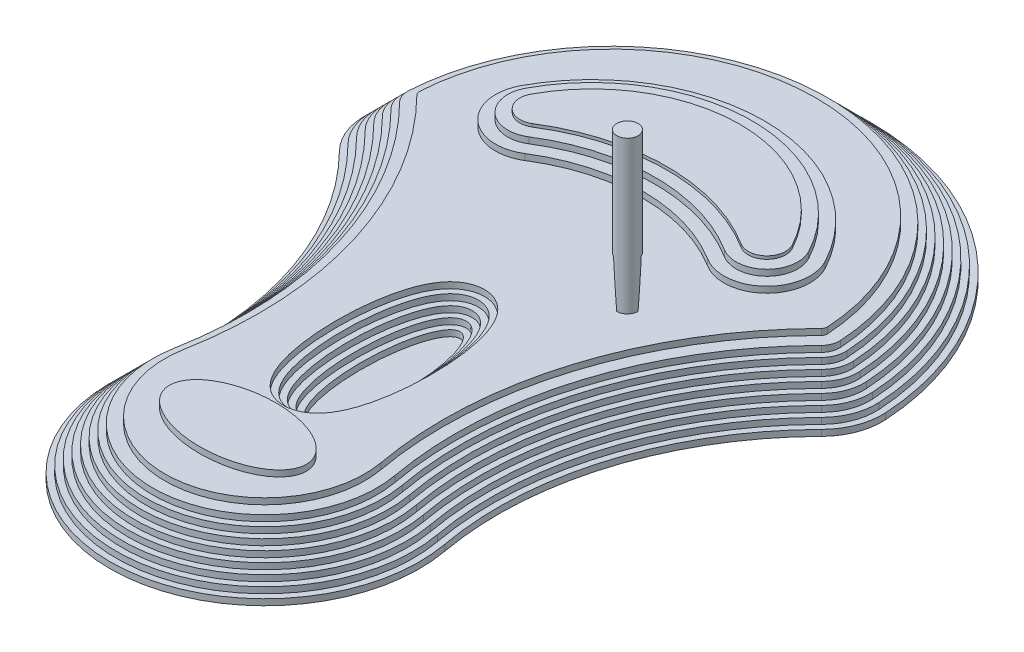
from build123d import *

# Parameters (mm, degrees)
BOSS_EXTRUDE1_DEPTH          = 2
BOSS_EXTRUDE2_DEPTH          = 2
BOSS_EXTRUDE3_DEPTH          = 2
BOSS_EXTRUDE4_DEPTH          = 2
SKETCH6_RX                   = 25
SKETCH6_RY                   = 7.5
BOSS_EXTRUDE5_DEPTH          = 2
BOSS_EXTRUDE6_DEPTH          = 2
BOSS_EXTRUDE7_DEPTH          = 2
BOSS_EXTRUDE8_DEPTH          = 2
BOSS_EXTRUDE9_DEPTH          = 2
SKETCH11_RX                  = 22.5
SKETCH11_RY                  = 12.5
BOSS_EXTRUDE10_DEPTH         = 2
BOSS_EXTRUDE11_DEPTH         = 2
BOSS_EXTRUDE12_DEPTH         = 1
BOSS_EXTRUDE13_START         = 2
SKETCH14_R                   = 3.5
BOSS_EXTRUDE13_DEPTH         = 50
CUT_EXTRUDE1_DEPTH           = 15
CUT_EXTRUDE1_DRAFT           = -5
CUT_EXTRUDE1_PROFILE_2_DEPTH = 15
CUT_EXTRUDE1_PROFILE_2_DRAFT = -5


with BuildPart() as part:
    # Sketch2 → Boss-Extrude1 (new body)
    with BuildSketch(Plane(origin=(0, 0, 0), x_dir=(1, 0, 0), z_dir=(0, 1, 0))):
        with BuildLine():
            ThreePointArc((84.993020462, 169.842764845), (0, 250), (-84.993020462, 169.842764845))
            ThreePointArc((-84.993020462, 169.842764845), (-83.737303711, 161.606035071), (-79.234438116, 154.595703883))
            ThreePointArc((-79.234438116, 154.595703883), (-53.016197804, 110.883102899), (-50, 60))
            ThreePointArc((-50, 60), (0, 0), (50, 60))
            ThreePointArc((50, 60), (53.016197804, 110.883102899), (79.234438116, 154.595703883))
            ThreePointArc((79.234438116, 154.595703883), (83.737303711, 161.606035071), (84.993020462, 169.842764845))
        make_face()
    extrude(amount=BOSS_EXTRUDE1_DEPTH)

    # Sketch3 → Boss-Extrude2 (add)
    with BuildSketch(Plane(origin=(0, 2, 0), x_dir=(1, 0, 0), z_dir=(0, 1, 0))):
        with BuildLine():
            ThreePointArc((77.81372295, 156.003385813), (81.866301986, 162.312683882), (82.996447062, 169.725740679))
            ThreePointArc((82.996447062, 169.725740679), (0, 248), (-82.996447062, 169.725740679))
            ThreePointArc((-82.996447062, 169.725740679), (-81.866301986, 162.312683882), (-77.81372295, 156.003385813))
            ThreePointArc((-77.81372295, 156.003385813), (-51.105368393, 111.473637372), (-48.032786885, 59.639344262))
            ThreePointArc((-48.032786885, 59.639344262), (0, 2), (48.032786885, 59.639344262))
            ThreePointArc((48.032786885, 59.639344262), (51.105368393, 111.473637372), (77.81372295, 156.003385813))
        make_face()
    extrude(amount=BOSS_EXTRUDE2_DEPTH)

    # Sketch4 → Boss-Extrude3 (add)
    with BuildSketch(Plane(origin=(0, 4, 0), x_dir=(1, 0, 0), z_dir=(0, 1, 0))):
        with BuildLine():
            ThreePointArc((76.393007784, 157.411067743), (49.194538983, 112.064171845), (46.06557377, 59.278688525))
            ThreePointArc((46.06557377, 59.278688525), (0, 4), (-46.06557377, 59.278688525))
            ThreePointArc((-46.06557377, 59.278688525), (-49.194538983, 112.064171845), (-76.393007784, 157.411067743))
            ThreePointArc((-76.393007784, 157.411067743), (-79.99530026, 163.019332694), (-80.999873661, 169.608716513))
            ThreePointArc((-80.999873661, 169.608716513), (0, 246), (80.999873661, 169.608716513))
            ThreePointArc((80.999873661, 169.608716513), (79.99530026, 163.019332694), (76.393007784, 157.411067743))
        make_face()
    extrude(amount=BOSS_EXTRUDE3_DEPTH)

    # Sketch5 → Boss-Extrude4 (add)
    with BuildSketch(Plane(origin=(0, 6, 0), x_dir=(1, 0, 0), z_dir=(0, 1, 0))):
        with BuildLine():
            ThreePointArc((74.972292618, 158.818749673), (78.124298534, 163.725981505), (79.00330026, 169.491692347))
            ThreePointArc((79.00330026, 169.491692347), (0, 244), (-79.00330026, 169.491692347))
            ThreePointArc((-79.00330026, 169.491692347), (-78.124298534, 163.725981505), (-74.972292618, 158.818749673))
            ThreePointArc((-74.972292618, 158.818749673), (-47.283709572, 112.654706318), (-44.098360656, 58.918032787))
            ThreePointArc((-44.098360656, 58.918032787), (0, 6), (44.098360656, 58.918032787))
            ThreePointArc((44.098360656, 58.918032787), (47.283709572, 112.654706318), (74.972292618, 158.818749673))
        make_face()
    extrude(amount=BOSS_EXTRUDE4_DEPTH)

    # Sketch6 → Boss-Extrude5 (add)
    with BuildSketch(Plane(origin=(0, 8, 0), x_dir=(1, 0, 0), z_dir=(0, 1, 0))):
        with BuildLine():
            ThreePointArc((73.551577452, 160.226431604), (45.372880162, 113.245240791), (42.131147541, 58.557377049))
            ThreePointArc((42.131147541, 58.557377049), (0, 8), (-42.131147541, 58.557377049))
            ThreePointArc((-42.131147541, 58.557377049), (-45.372880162, 113.245240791), (-73.551577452, 160.226431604))
            ThreePointArc((-73.551577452, 160.226431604), (-76.253296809, 164.432630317), (-77.006726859, 169.374668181))
            ThreePointArc((-77.006726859, 169.374668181), (0, 242), (77.006726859, 169.374668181))
            ThreePointArc((77.006726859, 169.374668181), (76.253296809, 164.432630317), (73.551577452, 160.226431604))
        make_face()
        with Locations(Location((0, 90), (0, 0, 90))):
            Ellipse(SKETCH6_RX, SKETCH6_RY, mode=Mode.SUBTRACT)
    extrude(amount=BOSS_EXTRUDE5_DEPTH)

    # Sketch7 → Boss-Extrude6 (add)
    with BuildSketch(Plane(origin=(0, 10, 0), x_dir=(1, 0, 0), z_dir=(0, 1, 0))):
        with BuildLine():
            ThreePointArc((72.130862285, 161.634113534), (74.382295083, 165.139279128), (75.010153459, 169.257644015))
            ThreePointArc((75.010153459, 169.257644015), (0, 240), (-75.010153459, 169.257644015))
            ThreePointArc((-75.010153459, 169.257644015), (-74.382295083, 165.139279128), (-72.130862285, 161.634113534))
            ThreePointArc((-72.130862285, 161.634113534), (-43.462050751, 113.835775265), (-40.163934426, 58.196721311))
            ThreePointArc((-40.163934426, 58.196721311), (0, 10), (40.163934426, 58.196721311))
            ThreePointArc((40.163934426, 58.196721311), (43.462050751, 113.835775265), (72.130862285, 161.634113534))
        make_face()
        with BuildLine():
            add(Edge.make_bspline(
                [(0, 63), (0.325638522, 63), (0.6446353, 63.037152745), (1.270377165, 63.179992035), (1.580018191, 63.287539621), (2.164968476, 63.55842676), (2.442332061, 63.721542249), (2.971325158, 64.094896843), (3.219533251, 64.302997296), (3.68254605, 64.745863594), (3.898862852, 64.981772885), (4.30742106, 65.47653604), (4.500372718, 65.736555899), (5.043524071, 66.535378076), (5.358753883, 67.091197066), (5.929882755, 68.232291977), (6.185263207, 68.817825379), (6.652882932, 70.010311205), (6.865011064, 70.617992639), (7.444553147, 72.443970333), (7.759677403, 73.673305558), (8.297315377, 76.14759818), (8.518868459, 77.392717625), (8.889342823, 79.895208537), (9.03798483, 81.152627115), (9.390124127, 84.94070343), (9.500938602, 87.494195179), (9.499049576, 92.56932897), (9.387606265, 95.098440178), (9.034576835, 98.877884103), (8.885502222, 100.135296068), (8.512678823, 102.644405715), (8.289260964, 103.89612872), (7.743966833, 106.392040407), (7.424517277, 107.627551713), (6.844140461, 109.443222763), (6.633516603, 110.042516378), (6.16684521, 111.225410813), (5.91104753, 111.809097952), (5.334148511, 112.95391138), (5.01354123, 113.513539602), (4.291269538, 114.565750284), (3.887450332, 115.063676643), (3.182281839, 115.729560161), (2.93436861, 115.933940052), (2.539084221, 116.208491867), (2.403407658, 116.294655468), (2.12330889, 116.455023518), (1.978283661, 116.529423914), (1.538241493, 116.728330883), (1.235886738, 116.830316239), (0.611611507, 116.967672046), (0.285022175, 117.002591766), (-0.357682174, 116.997097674), (-0.675532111, 116.958165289), (-1.147175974, 116.846752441), (-1.303760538, 116.800531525), (-1.608051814, 116.693090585), (-1.756709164, 116.631689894), (-2.192982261, 116.426133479), (-2.473188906, 116.258897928), (-2.997537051, 115.884129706), (-3.241938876, 115.677277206), (-3.933179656, 115.010749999), (-4.340316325, 114.501741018), (-5.056921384, 113.441876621), (-5.370996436, 112.886431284), (-5.941512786, 111.742293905), (-6.198373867, 111.150976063), (-6.663860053, 109.959342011), (-6.872999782, 109.358161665), (-7.447923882, 107.542692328), (-7.762101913, 106.316676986), (-8.298924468, 103.843847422), (-8.520705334, 102.596836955), (-8.89177981, 100.086344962), (-9.041026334, 98.820297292), (-9.392748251, 95.019570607), (-9.501041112, 92.490162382), (-9.498944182, 87.438987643), (-9.388463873, 84.917224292), (-9.036648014, 81.141082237), (-8.887942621, 79.883466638), (-8.515290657, 77.37086469), (-8.290900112, 76.112681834), (-7.74690502, 73.6201113), (-7.427805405, 72.383497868), (-6.845225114, 70.559791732), (-6.634114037, 69.959140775), (-6.167756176, 68.776755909), (-5.912717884, 68.194932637), (-5.483533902, 67.342182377), (-5.332625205, 67.061295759), (-5.011268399, 66.507897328), (-4.840694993, 66.235331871), (-4.479426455, 65.707710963), (-4.288325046, 65.451850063), (-3.879656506, 64.960228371), (-3.660580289, 64.723066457), (-2.964923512, 64.063311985), (-2.452570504, 63.690634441), (-1.280050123, 63.14961568), (-0.651277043, 63), (0, 63)],
                knots=[0, 0, 0, 0, 0.0078125, 0.0078125, 0.015625, 0.015625, 0.0234375, 0.0234375, 0.03125, 0.03125, 0.0390625, 0.0390625, 0.046875, 0.046875, 0.0625, 0.0625, 0.078125, 0.078125, 0.09375, 0.09375, 0.125, 0.125, 0.15625, 0.15625, 0.1875, 0.1875, 0.25, 0.25, 0.3125, 0.3125, 0.34375, 0.34375, 0.375, 0.375, 0.40625, 0.40625, 0.421875, 0.421875, 0.4375, 0.4375, 0.453125, 0.453125, 0.46875, 0.46875, 0.4765625, 0.4765625, 0.48046875, 0.48046875, 0.484375, 0.484375, 0.4921875, 0.4921875, 0.5, 0.5, 0.5078125, 0.5078125, 0.51171875, 0.51171875, 0.515625, 0.515625, 0.5234375, 0.5234375, 0.53125, 0.53125, 0.546875, 0.546875, 0.5625, 0.5625, 0.578125, 0.578125, 0.59375, 0.59375, 0.625, 0.625, 0.65625, 0.65625, 0.6875, 0.6875, 0.75, 0.75, 0.8125, 0.8125, 0.84375, 0.84375, 0.875, 0.875, 0.90625, 0.90625, 0.921875, 0.921875, 0.9375, 0.9375, 0.9453125, 0.9453125, 0.953125, 0.953125, 0.9609375, 0.9609375, 0.96875, 0.96875, 0.984375, 0.984375, 1, 1, 1, 1], degree=3))
        make_face(mode=Mode.SUBTRACT)
    extrude(amount=BOSS_EXTRUDE6_DEPTH)

    # Sketch8 → Boss-Extrude7 (add)
    with BuildSketch(Plane(origin=(0, 12, 0), x_dir=(1, 0, 0), z_dir=(0, 1, 0))):
        with BuildLine():
            ThreePointArc((70.710147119, 163.041795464), (41.551221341, 114.426309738), (38.196721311, 57.836065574))
            ThreePointArc((38.196721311, 57.836065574), (0, 12), (-38.196721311, 57.836065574))
            ThreePointArc((-38.196721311, 57.836065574), (-41.551221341, 114.426309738), (-70.710147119, 163.041795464))
            ThreePointArc((-70.710147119, 163.041795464), (-72.511293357, 165.845927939), (-73.013580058, 169.140619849))
            ThreePointArc((-73.013580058, 169.140619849), (0, 238), (73.013580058, 169.140619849))
            ThreePointArc((73.013580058, 169.140619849), (72.511293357, 165.845927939), (70.710147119, 163.041795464))
        make_face()
        with BuildLine():
            add(Edge.make_bspline(
                [(-0.053426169, 118.999771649), (-0.769278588, 118.993652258), (-1.462774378, 118.867022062), (-2.471710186, 118.508315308), (-2.796424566, 118.362256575), (-3.41787529, 118.02559468), (-3.715979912, 117.834729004), (-4.288798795, 117.411233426), (-4.560503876, 117.180663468), (-5.071483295, 116.694420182), (-5.312155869, 116.437700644), (-5.996705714, 115.633157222), (-6.405814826, 115.046738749), (-7.134462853, 113.837607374), (-7.455804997, 113.213062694), (-8.040094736, 111.936830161), (-8.302418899, 111.284852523), (-8.782648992, 109.960250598), (-9.000486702, 109.286139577), (-9.397082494, 107.936441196), (-9.576059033, 107.258932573), (-10.066228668, 105.219970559), (-10.332781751, 103.852372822), (-10.775825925, 101.104781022), (-10.952528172, 99.724816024), (-11.230822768, 96.95454774), (-11.332939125, 95.56431658), (-11.467885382, 92.774317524), (-11.500466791, 91.372417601), (-11.499051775, 87.167508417), (-11.366636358, 84.381726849), (-10.947436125, 80.232400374), (-10.770121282, 78.854291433), (-10.32575615, 76.110012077), (-10.058611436, 74.743854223), (-9.567185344, 72.706685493), (-9.387779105, 72.029704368), (-8.990149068, 70.680906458), (-8.771626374, 70.006878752), (-8.288007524, 68.678019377), (-8.023593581, 68.023375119), (-7.580646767, 67.061463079), (-7.425256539, 66.744176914), (-7.096121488, 66.117550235), (-6.921970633, 65.80781278), (-6.372427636, 64.903397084), (-5.968940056, 64.330072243), (-5.285135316, 63.532771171), (-5.044049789, 63.277495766), (-4.529911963, 62.79244819), (-4.25488621, 62.56099042), (-3.681671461, 62.141625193), (-3.382795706, 61.952619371), (-2.75831387, 61.619658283), (-2.429988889, 61.47450515), (-1.420837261, 61.123351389), (-0.72674885, 61.00110487), (0.707611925, 60.998909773), (1.404158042, 61.119188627), (2.757883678, 61.587269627), (3.382194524, 61.924468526), (4.537943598, 62.767428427), (5.048123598, 63.257007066), (5.968264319, 64.328656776), (6.380660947, 64.915544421), (7.113272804, 66.12333634), (7.436569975, 66.748182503), (8.024744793, 68.026331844), (8.288789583, 68.680040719), (8.772345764, 70.009151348), (8.990832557, 70.683135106), (9.388617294, 72.032603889), (9.568205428, 72.710320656), (10.060114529, 74.75070979), (10.327817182, 76.12027539), (10.772849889, 78.873368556), (10.950460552, 80.256852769), (11.230060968, 83.035504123), (11.332470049, 84.430606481), (11.467871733, 87.23153558), (11.50064207, 88.639074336), (11.498687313, 92.844216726), (11.365940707, 95.634700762), (10.943826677, 99.798466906), (10.765101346, 101.182644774), (10.316391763, 103.942013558), (10.046138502, 105.317177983), (9.547269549, 107.370718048), (9.364728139, 108.053809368), (8.963177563, 109.404488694), (8.744324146, 110.073514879), (8.259237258, 111.395020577), (7.993532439, 112.047684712), (7.39726865, 113.330363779), (7.069931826, 113.954675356), (6.335566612, 115.150950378), (5.929277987, 115.724154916), (5.230578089, 116.527047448), (4.984045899, 116.783047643), (4.466856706, 117.262029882), (4.195159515, 117.485811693), (3.621525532, 117.897119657), (3.316758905, 118.086013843), (2.689699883, 118.412284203), (2.36735233, 118.550473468), (1.704132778, 118.77444703), (1.363301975, 118.860347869), (0.661331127, 118.974695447), (0.304500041, 119.002831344), (-0.053426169, 118.999771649)],
                knots=[0, 0, 0, 0, 0.015625, 0.015625, 0.0234375, 0.0234375, 0.03125, 0.03125, 0.0390625, 0.0390625, 0.046875, 0.046875, 0.0625, 0.0625, 0.078125, 0.078125, 0.09375, 0.09375, 0.109375, 0.109375, 0.125, 0.125, 0.15625, 0.15625, 0.1875, 0.1875, 0.21875, 0.21875, 0.25, 0.25, 0.3125, 0.3125, 0.34375, 0.34375, 0.375, 0.375, 0.390625, 0.390625, 0.40625, 0.40625, 0.421875, 0.421875, 0.4296875, 0.4296875, 0.4375, 0.4375, 0.453125, 0.453125, 0.4609375, 0.4609375, 0.46875, 0.46875, 0.4765625, 0.4765625, 0.484375, 0.484375, 0.5, 0.5, 0.515625, 0.515625, 0.53125, 0.53125, 0.546875, 0.546875, 0.5625, 0.5625, 0.578125, 0.578125, 0.59375, 0.59375, 0.609375, 0.609375, 0.625, 0.625, 0.65625, 0.65625, 0.6875, 0.6875, 0.71875, 0.71875, 0.75, 0.75, 0.8125, 0.8125, 0.84375, 0.84375, 0.875, 0.875, 0.890625, 0.890625, 0.90625, 0.90625, 0.921875, 0.921875, 0.9375, 0.9375, 0.953125, 0.953125, 0.9609375, 0.9609375, 0.96875, 0.96875, 0.9765625, 0.9765625, 0.984375, 0.984375, 0.9921875, 0.9921875, 1, 1, 1, 1], degree=3))
        make_face(mode=Mode.SUBTRACT)
    extrude(amount=BOSS_EXTRUDE7_DEPTH)

    # Sketch9 → Boss-Extrude8 (add)
    with BuildSketch(Plane(origin=(0, 14, 0), x_dir=(1, 0, 0), z_dir=(0, 1, 0))):
        with BuildLine():
            ThreePointArc((69.289431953, 164.449477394), (70.640291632, 166.552576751), (71.017006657, 169.023595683))
            ThreePointArc((71.017006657, 169.023595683), (0, 236), (-71.017006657, 169.023595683))
            ThreePointArc((-71.017006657, 169.023595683), (-70.640291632, 166.552576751), (-69.289431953, 164.449477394))
            ThreePointArc((-69.289431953, 164.449477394), (-39.64039193, 115.016844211), (-36.229508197, 57.475409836))
            ThreePointArc((-36.229508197, 57.475409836), (0, 14), (36.229508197, 57.475409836))
            ThreePointArc((36.229508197, 57.475409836), (39.64039193, 115.016844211), (69.289431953, 164.449477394))
        make_face()
        with BuildLine():
            add(Edge.make_bspline(
                [(-0.012629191, 59.000009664), (0.770008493, 58.998811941), (1.534188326, 59.107037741), (2.653979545, 59.426348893), (3.023779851, 59.559644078), (3.734034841, 59.869906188), (4.07715051, 60.047559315), (4.740838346, 60.445134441), (5.06286345, 60.666210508), (5.6787524, 61.142954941), (5.970423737, 61.396763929), (6.802485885, 62.198935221), (7.300382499, 62.78760771), (7.98123071, 63.733221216), (8.196090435, 64.057596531), (8.600886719, 64.7153477), (8.791623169, 65.04976691), (9.33399082, 66.067210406), (9.656533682, 66.764062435), (10.243929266, 68.185190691), (10.508637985, 68.909870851), (10.992515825, 70.379516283), (11.209671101, 71.117808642), (11.801849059, 73.340985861), (12.119399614, 74.833916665), (12.645903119, 77.834981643), (12.854678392, 79.343140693), (13.182816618, 82.371976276), (13.302603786, 83.89259342), (13.461396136, 86.945136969), (13.500236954, 88.479559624), (13.499522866, 93.082258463), (13.345579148, 96.130488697), (12.853171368, 100.668354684), (12.644348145, 102.175084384), (12.117794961, 105.174183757), (11.799997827, 106.666544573), (11.207429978, 108.889807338), (10.990163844, 109.628291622), (10.505706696, 111.098677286), (10.240078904, 111.825126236), (9.650270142, 113.250226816), (9.325879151, 113.949602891), (8.597192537, 115.312654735), (8.190740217, 115.978537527), (7.288651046, 117.227680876), (6.790990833, 117.814036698), (5.953040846, 118.618591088), (5.656969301, 118.875025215), (5.043781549, 119.347350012), (4.725419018, 119.564630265), (4.063849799, 119.959329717), (3.720567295, 120.136627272), (3.006587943, 120.447237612), (2.639237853, 120.578695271), (1.898283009, 120.788454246), (1.522502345, 120.867530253), (0.760240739, 120.97361895), (0.37190259, 121.00080565), (-0.797884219, 120.998324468), (-1.560484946, 120.888126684), (-2.679344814, 120.565326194), (-3.048046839, 120.431049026), (-3.756171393, 120.119004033), (-4.098430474, 119.940505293), (-4.760895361, 119.541512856), (-5.082834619, 119.319511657), (-5.696171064, 118.84224194), (-5.986760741, 118.58816535), (-6.816328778, 117.785406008), (-7.313269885, 117.196350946), (-8.219473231, 115.934034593), (-8.619995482, 115.273498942), (-9.341215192, 113.917813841), (-9.662980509, 113.221243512), (-10.249347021, 111.800542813), (-10.514015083, 111.074958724), (-10.996399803, 109.607639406), (-11.212980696, 108.870414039), (-11.803771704, 106.650197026), (-12.120797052, 105.158920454), (-12.646519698, 102.16067275), (-12.855039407, 100.653675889), (-13.182906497, 97.626762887), (-13.302819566, 96.106928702), (-13.461672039, 93.055528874), (-13.5002027, 91.520643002), (-13.499592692, 86.924760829), (-13.346206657, 83.879437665), (-12.854657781, 79.343240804), (-12.646103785, 77.836610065), (-12.119883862, 74.836613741), (-11.802347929, 73.343232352), (-11.209525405, 71.117325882), (-10.991306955, 70.375664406), (-10.508714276, 68.910098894), (-10.244601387, 68.186878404), (-9.657098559, 66.765280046), (-9.333741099, 66.066888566), (-8.788377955, 65.044583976), (-8.595885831, 64.707372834), (-8.19113625, 64.050027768), (-7.978620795, 63.729212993), (-7.305534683, 62.79430757), (-6.810168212, 62.207179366), (-5.973082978, 61.399352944), (-5.679476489, 61.143711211), (-5.070797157, 60.671264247), (-4.754183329, 60.453432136), (-4.094670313, 60.057153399), (-3.751204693, 59.878444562), (-3.037961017, 59.565033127), (-2.674847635, 59.433390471), (-1.935635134, 59.220241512), (-1.559514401, 59.138818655), (-0.793573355, 59.028865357), (-0.403948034, 59.000608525), (-0.012629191, 59.000009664)],
                knots=[0, 0, 0, 0, 0.015625, 0.015625, 0.0234375, 0.0234375, 0.03125, 0.03125, 0.0390625, 0.0390625, 0.046875, 0.046875, 0.0625, 0.0625, 0.0703125, 0.0703125, 0.078125, 0.078125, 0.09375, 0.09375, 0.109375, 0.109375, 0.125, 0.125, 0.15625, 0.15625, 0.1875, 0.1875, 0.21875, 0.21875, 0.25, 0.25, 0.3125, 0.3125, 0.34375, 0.34375, 0.375, 0.375, 0.390625, 0.390625, 0.40625, 0.40625, 0.421875, 0.421875, 0.4375, 0.4375, 0.453125, 0.453125, 0.4609375, 0.4609375, 0.46875, 0.46875, 0.4765625, 0.4765625, 0.484375, 0.484375, 0.4921875, 0.4921875, 0.5, 0.5, 0.515625, 0.515625, 0.5234375, 0.5234375, 0.53125, 0.53125, 0.5390625, 0.5390625, 0.546875, 0.546875, 0.5625, 0.5625, 0.578125, 0.578125, 0.59375, 0.59375, 0.609375, 0.609375, 0.625, 0.625, 0.65625, 0.65625, 0.6875, 0.6875, 0.71875, 0.71875, 0.75, 0.75, 0.8125, 0.8125, 0.84375, 0.84375, 0.875, 0.875, 0.890625, 0.890625, 0.90625, 0.90625, 0.921875, 0.921875, 0.9296875, 0.9296875, 0.9375, 0.9375, 0.953125, 0.953125, 0.9609375, 0.9609375, 0.96875, 0.96875, 0.9765625, 0.9765625, 0.984375, 0.984375, 0.9921875, 0.9921875, 1, 1, 1, 1], degree=3))
        make_face(mode=Mode.SUBTRACT)
    extrude(amount=BOSS_EXTRUDE8_DEPTH)

    # Sketch10 → Boss-Extrude9 (add)
    with BuildSketch(Plane(origin=(0, 16, 0), x_dir=(1, 0, 0), z_dir=(0, 1, 0))):
        with BuildLine():
            ThreePointArc((66.448001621, 167.264841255), (35.818733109, 116.197913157), (32.295081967, 56.754098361))
            ThreePointArc((32.295081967, 56.754098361), (0, 18), (-32.295081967, 56.754098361))
            ThreePointArc((-32.295081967, 56.754098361), (-35.818733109, 116.197913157), (-66.448001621, 167.264841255))
            ThreePointArc((-66.448001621, 167.264841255), (-66.89828818, 167.965874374), (-67.023859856, 168.789547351))
            ThreePointArc((-67.023859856, 168.789547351), (0, 232), (67.023859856, 168.789547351))
            ThreePointArc((67.023859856, 168.789547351), (66.89828818, 167.965874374), (66.448001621, 167.264841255))
        make_face()
        with BuildLine():
            add(Edge.make_bspline(
                [(-0.022268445, 122.99997409), (-0.868771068, 122.998178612), (-1.699084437, 122.893383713), (-2.920912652, 122.585777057), (-3.326114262, 122.457196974), (-4.110540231, 122.156736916), (-4.4915795, 121.984392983), (-5.232407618, 121.597648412), (-5.592218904, 121.383292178), (-6.291252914, 120.913832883), (-6.629619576, 120.659006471), (-7.595203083, 119.852512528), (-8.180745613, 119.254442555), (-8.986044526, 118.281527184), (-9.241412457, 117.945328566), (-9.723386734, 117.260826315), (-9.951015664, 116.911247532), (-10.598824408, 115.843269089), (-10.984367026, 115.105869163), (-11.685341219, 113.592609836), (-12.001850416, 112.813747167), (-12.574071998, 111.241356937), (-12.829635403, 110.449463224), (-13.525900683, 108.060644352), (-13.897070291, 106.450747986), (-14.5102023, 103.206851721), (-14.752734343, 101.572958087), (-15.133390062, 98.285693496), (-15.27227255, 96.632464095), (-15.456176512, 93.30849557), (-15.500111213, 91.649802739), (-15.499777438, 86.683900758), (-15.325565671, 83.38618073), (-14.757554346, 78.462306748), (-14.515569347, 76.824913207), (-13.899640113, 73.559895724), (-13.522621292, 71.926355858), (-12.593257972, 68.741483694), (-12.042569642, 67.183116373), (-11.002154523, 64.930486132), (-10.618960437, 64.194023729), (-9.969885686, 63.118755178), (-9.740123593, 62.763930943), (-9.255369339, 62.072902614), (-9.001331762, 61.737710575), (-8.200214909, 60.766661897), (-7.6134841, 60.164554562), (-6.315241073, 59.076285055), (-5.622344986, 58.607207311), (-4.511984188, 58.025357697), (-4.130079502, 57.851613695), (-3.340885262, 57.547651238), (-2.936512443, 57.418945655), (-1.718450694, 57.11020673), (-0.890362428, 57.003856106), (0.376595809, 56.998224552), (0.801540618, 57.022485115), (1.635303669, 57.12197626), (2.047109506, 57.197129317), (2.860829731, 57.396949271), (3.262749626, 57.521588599), (4.056725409, 57.82024373), (4.442061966, 57.992034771), (5.187886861, 58.37670774), (5.548885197, 58.58977034), (6.248289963, 59.055197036), (6.58824035, 59.308697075), (7.564553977, 60.11732774), (8.150887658, 60.713688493), (8.953190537, 61.676733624), (9.20767989, 62.00923581), (9.693574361, 62.694724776), (9.925626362, 63.04896086), (10.582479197, 64.126397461), (10.970390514, 64.866374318), (12.024233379, 67.133975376), (12.583010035, 68.708356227), (13.524983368, 71.932188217), (13.89837733, 73.554296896), (14.513470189, 76.812268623), (14.755598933, 78.448086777), (15.324537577, 83.371985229), (15.499939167, 86.675878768), (15.500030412, 91.659188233), (15.45579078, 93.328731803), (15.271080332, 96.654133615), (15.131204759, 98.310312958), (14.74798491, 101.608471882), (14.503530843, 103.250299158), (14.038282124, 105.699512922), (13.866308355, 106.513599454), (13.48199156, 108.136232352), (13.269574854, 108.94639083), (12.563064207, 111.350070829), (12.003647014, 112.92052007), (10.939441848, 115.194716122), (10.548140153, 115.933892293), (9.682155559, 117.346136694), (9.206536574, 118.021732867), (8.409661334, 118.975368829), (8.130069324, 119.283245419), (7.539335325, 119.876404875), (7.226501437, 120.162863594), (6.256469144, 120.965127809), (5.56314154, 121.429124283), (4.445043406, 122.006473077), (4.056790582, 122.179650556), (3.271769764, 122.4755052), (2.873542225, 122.599414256), (2.065522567, 122.798648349), (1.655737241, 122.874001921), (0.824364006, 122.975125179), (0.400982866, 123.000871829), (-0.022268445, 122.99997409)],
                knots=[0, 0, 0, 0, 0.015625, 0.015625, 0.0234375, 0.0234375, 0.03125, 0.03125, 0.0390625, 0.0390625, 0.046875, 0.046875, 0.0625, 0.0625, 0.0703125, 0.0703125, 0.078125, 0.078125, 0.09375, 0.09375, 0.109375, 0.109375, 0.125, 0.125, 0.15625, 0.15625, 0.1875, 0.1875, 0.21875, 0.21875, 0.25, 0.25, 0.3125, 0.3125, 0.34375, 0.34375, 0.375, 0.375, 0.40625, 0.40625, 0.421875, 0.421875, 0.4296875, 0.4296875, 0.4375, 0.4375, 0.453125, 0.453125, 0.46875, 0.46875, 0.4765625, 0.4765625, 0.484375, 0.484375, 0.5, 0.5, 0.5078125, 0.5078125, 0.515625, 0.515625, 0.5234375, 0.5234375, 0.53125, 0.53125, 0.5390625, 0.5390625, 0.546875, 0.546875, 0.5625, 0.5625, 0.5703125, 0.5703125, 0.578125, 0.578125, 0.59375, 0.59375, 0.625, 0.625, 0.65625, 0.65625, 0.6875, 0.6875, 0.75, 0.75, 0.78125, 0.78125, 0.8125, 0.8125, 0.84375, 0.84375, 0.859375, 0.859375, 0.875, 0.875, 0.90625, 0.90625, 0.921875, 0.921875, 0.9375, 0.9375, 0.9453125, 0.9453125, 0.953125, 0.953125, 0.96875, 0.96875, 0.9765625, 0.9765625, 0.984375, 0.984375, 0.9921875, 0.9921875, 1, 1, 1, 1], degree=3))
        make_face(mode=Mode.SUBTRACT)
    extrude(amount=BOSS_EXTRUDE9_DEPTH)

    # Sketch11 → Boss-Extrude10 (add)
    with BuildSketch(Plane(origin=(0, 18, 0), x_dir=(1, 0, 0), z_dir=(0, 1, 0))):
        with Locations(Location((0, 42), (0, 0, 180))):
            Ellipse(SKETCH11_RX, SKETCH11_RY)
        with BuildLine():
            ThreePointArc((-50, 185), (0, 215), (50, 185))
            ThreePointArc((50, 185), (47.162091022, 167.995734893), (30, 166.364357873))
            ThreePointArc((30, 166.364357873), (0, 175), (-30, 166.364357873))
            ThreePointArc((-30, 166.364357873), (-47.162091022, 167.995734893), (-50, 185))
        make_face()
    extrude(amount=BOSS_EXTRUDE10_DEPTH)

    # Sketch12 → Boss-Extrude11 (add)
    with BuildSketch(Plane(origin=(0, 20, 0), x_dir=(1, 0, 0), z_dir=(0, 1, 0))):
        with BuildLine():
            ThreePointArc((-46.470588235, 183.117647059), (-44.435245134, 170.922219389), (-32.126625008, 169.75219879))
            ThreePointArc((-32.126625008, 169.75219879), (0, 179), (32.126625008, 169.75219879))
            ThreePointArc((32.126625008, 169.75219879), (44.435245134, 170.922219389), (46.470588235, 183.117647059))
            ThreePointArc((46.470588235, 183.117647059), (0, 211), (-46.470588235, 183.117647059))
        make_face()
    extrude(amount=BOSS_EXTRUDE11_DEPTH)

    # Sketch13 → Boss-Extrude12 (add)
    with BuildSketch(Plane(origin=(0, 22, 0), x_dir=(1, 0, 0), z_dir=(0, 1, 0))):
        with BuildLine():
            ThreePointArc((42.941176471, 181.235294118), (0, 207), (-42.941176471, 181.235294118))
            ThreePointArc((-42.941176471, 181.235294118), (-41.708399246, 173.848703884), (-34.253250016, 173.140039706))
            ThreePointArc((-34.253250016, 173.140039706), (0, 183), (34.253250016, 173.140039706))
            ThreePointArc((34.253250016, 173.140039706), (41.708399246, 173.848703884), (42.941176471, 181.235294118))
        make_face()
    extrude(amount=BOSS_EXTRUDE12_DEPTH)


with BuildPart() as body_2:
    # Sketch14 → Boss-Extrude13 (new body)
    with BuildSketch(Plane(origin=(0, 18, 0), x_dir=(1, 0, 0), z_dir=(0, 1, 0)).offset(BOSS_EXTRUDE13_START)):
        with Locations(Location((30, 140, 0), (0, 0, 270))):
            Circle(SKETCH14_R)
    extrude(amount=BOSS_EXTRUDE13_DEPTH)


with BuildPart() as cut_extrude1_tool:
    # Sketch15 → Cut-Extrude1 (with draft: the straight prism first)
    with BuildSketch(Plane.XZ.offset(-20)):
        Polygon((26.5, -140), (30, -140), (30, -136.5), (30, -132.655492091), (23.225915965, -140), align=None)
    extrude(amount=-CUT_EXTRUDE1_DEPTH)
    # Cut-Extrude1: the draft: its side faces are tilted about the plane it starts from
    cut_extrude1_sides = [cut_extrude1_tool.faces().sort_by_distance(p)[0] for p in [
        (26.612957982, 27.5, -140),
        (26.612957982, 27.5, -136.327746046),
        (30, 27.5, -136.327746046),
    ]]
    draft(cut_extrude1_sides, Plane.XZ.offset(-20), CUT_EXTRUDE1_DRAFT)


with BuildPart() as body_2_1:
    add(body_2.part)

    # Cut-Extrude1: cut by cut_extrude1_tool
    add(cut_extrude1_tool.part, mode=Mode.SUBTRACT)


with BuildPart() as cut_extrude1_profile_2_tool:
    # Sketch15 → Cut-Extrude1 profile 2 (with draft: the straight prism first)
    with BuildSketch(Plane.XZ.offset(-20)):
        Polygon((37.671515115, -140), (30, -140), (30, -148.31750878), align=None)
    extrude(amount=-CUT_EXTRUDE1_PROFILE_2_DEPTH)
    # Cut-Extrude1 profile 2: the draft: its side faces are tilted about the plane it starts from
    cut_extrude1_profile_2_sides = [cut_extrude1_profile_2_tool.faces().sort_by_distance(p)[0] for p in [
        (33.835757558, 27.5, -140),
        (30, 27.5, -144.15875439),
        (33.835757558, 27.5, -144.15875439),
    ]]
    draft(cut_extrude1_profile_2_sides, Plane.XZ.offset(-20), CUT_EXTRUDE1_PROFILE_2_DRAFT)


with BuildPart() as body_2_2:
    add(body_2_1.part)

    # Cut-Extrude1 profile 2: cut by cut_extrude1_profile_2_tool
    add(cut_extrude1_profile_2_tool.part, mode=Mode.SUBTRACT)


solid = Compound([part.part, body_2_2.part])
